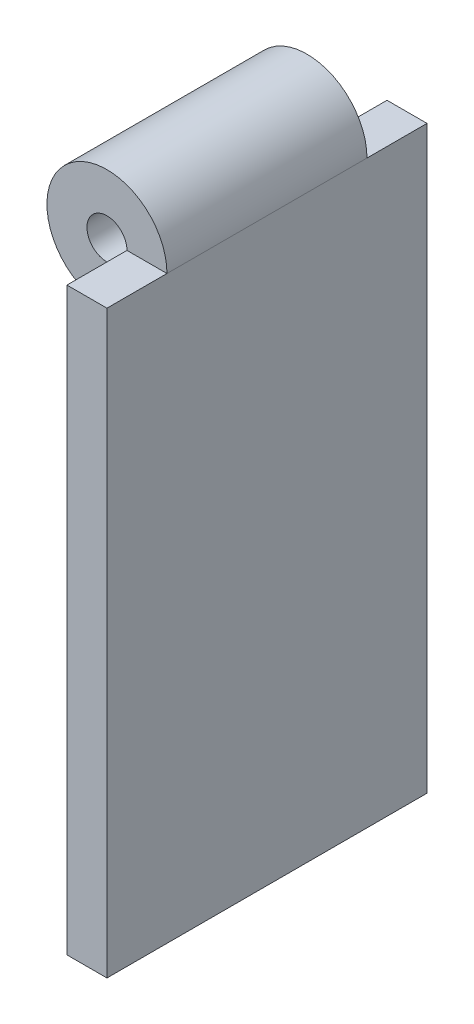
ISO-10303-21;
HEADER;
FILE_DESCRIPTION(('STEP AP214'),'2;1');
FILE_NAME('part.step','',(''),(''),'','','');
FILE_SCHEMA(('AUTOMOTIVE_DESIGN { 1 0 10303 214 1 1 1 1 }'));
ENDSEC;
DATA;
#1=APPLICATION_CONTEXT('core data for automotive mechanical design processes');
#2=APPLICATION_PROTOCOL_DEFINITION('international standard','automotive_design',2000,#1);
#3=PRODUCT_CONTEXT('',#1,'mechanical');
#4=PRODUCT('Part','Part','',(#3));
#5=PRODUCT_RELATED_PRODUCT_CATEGORY('part','',(#4));
#6=PRODUCT_DEFINITION_FORMATION('','',#4);
#7=PRODUCT_DEFINITION_CONTEXT('part definition',#1,'design');
#8=PRODUCT_DEFINITION('design','',#6,#7);
#9=PRODUCT_DEFINITION_SHAPE('','',#8);
#10=(LENGTH_UNIT() NAMED_UNIT(*) SI_UNIT(.MILLI.,.METRE.));
#11=(NAMED_UNIT(*) PLANE_ANGLE_UNIT() SI_UNIT($,.RADIAN.));
#12=(NAMED_UNIT(*) SI_UNIT($,.STERADIAN.) SOLID_ANGLE_UNIT());
#13=UNCERTAINTY_MEASURE_WITH_UNIT(LENGTH_MEASURE(1.E-05),#10,'distance_accuracy_value','');
#14=(GEOMETRIC_REPRESENTATION_CONTEXT(3) GLOBAL_UNCERTAINTY_ASSIGNED_CONTEXT((#13)) GLOBAL_UNIT_ASSIGNED_CONTEXT((#10,
#11,#12)) REPRESENTATION_CONTEXT('',''));
#15=CARTESIAN_POINT('',(0.,0.,0.));
#16=DIRECTION('',(0.,0.,1.));
#17=DIRECTION('',(1.,0.,0.));
#18=AXIS2_PLACEMENT_3D('',#15,#16,#17);
#19=CARTESIAN_POINT('',(3.51561230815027,0.,40.));
#20=DIRECTION('',(0.,-1.,0.));
#21=DIRECTION('',(1.,0.,0.));
#22=AXIS2_PLACEMENT_3D('',#19,#20,#21);
#23=PLANE('',#22);
#24=DIRECTION('',(-1.,0.,0.));
#25=VECTOR('',#24,1.);
#26=CARTESIAN_POINT('',(3.51561230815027,0.,-25.));
#27=LINE('',#26,#25);
#28=CARTESIAN_POINT('',(10.,0.,-25.));
#29=VERTEX_POINT('',#28);
#30=CARTESIAN_POINT('',(0.,0.,-25.));
#31=VERTEX_POINT('',#30);
#32=EDGE_CURVE('E151',#29,#31,#27,.T.);
#33=ORIENTED_EDGE('',*,*,#32,.F.);
#34=DIRECTION('',(0.,0.,-1.));
#35=VECTOR('',#34,1.);
#36=CARTESIAN_POINT('',(10.,0.,40.));
#37=LINE('',#36,#35);
#38=CARTESIAN_POINT('',(10.,0.,-40.));
#39=VERTEX_POINT('',#38);
#40=EDGE_CURVE('E42',#29,#39,#37,.T.);
#41=ORIENTED_EDGE('',*,*,#40,.T.);
#42=DIRECTION('',(-1.,0.,0.));
#43=VECTOR('',#42,1.);
#44=CARTESIAN_POINT('',(3.51561230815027,0.,-40.));
#45=LINE('',#44,#43);
#46=CARTESIAN_POINT('',(0.,0.,-40.));
#47=VERTEX_POINT('',#46);
#48=EDGE_CURVE('E180',#39,#47,#45,.T.);
#49=ORIENTED_EDGE('',*,*,#48,.T.);
#50=DIRECTION('',(0.,0.,-1.));
#51=VECTOR('',#50,1.);
#52=CARTESIAN_POINT('',(0.,0.,40.));
#53=LINE('',#52,#51);
#54=EDGE_CURVE('E154',#31,#47,#53,.T.);
#55=ORIENTED_EDGE('',*,*,#54,.F.);
#56=EDGE_LOOP('',(#33,#41,#49,#55));
#57=FACE_BOUND('',#56,.T.);
#58=ADVANCED_FACE('F34',(#57),#23,.F.);
#59=CARTESIAN_POINT('',(10.,-191.830988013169,40.));
#60=DIRECTION('',(-1.,0.,0.));
#61=DIRECTION('',(0.,-1.,0.));
#62=AXIS2_PLACEMENT_3D('',#59,#60,#61);
#63=PLANE('',#62);
#64=DIRECTION('',(0.,1.,0.));
#65=VECTOR('',#64,1.);
#66=CARTESIAN_POINT('',(10.,-191.830988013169,-40.));
#67=LINE('',#66,#65);
#68=CARTESIAN_POINT('',(10.,-145.,-40.));
#69=VERTEX_POINT('',#68);
#70=EDGE_CURVE('E133',#69,#39,#67,.T.);
#71=ORIENTED_EDGE('',*,*,#70,.T.);
#72=ORIENTED_EDGE('',*,*,#40,.F.);
#73=DIRECTION('',(0.,0.,-1.));
#74=VECTOR('',#73,1.);
#75=CARTESIAN_POINT('',(10.,0.,25.));
#76=LINE('',#75,#74);
#77=CARTESIAN_POINT('',(10.,0.,25.));
#78=VERTEX_POINT('',#77);
#79=EDGE_CURVE('E112',#78,#29,#76,.T.);
#80=ORIENTED_EDGE('',*,*,#79,.F.);
#81=CARTESIAN_POINT('',(10.,0.,40.));
#82=VERTEX_POINT('',#81);
#83=EDGE_CURVE('E11',#82,#78,#37,.T.);
#84=ORIENTED_EDGE('',*,*,#83,.F.);
#85=DIRECTION('',(0.,1.,0.));
#86=VECTOR('',#85,1.);
#87=CARTESIAN_POINT('',(10.,-191.830988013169,40.));
#88=LINE('',#87,#86);
#89=CARTESIAN_POINT('',(10.,-145.,40.));
#90=VERTEX_POINT('',#89);
#91=EDGE_CURVE('E172',#90,#82,#88,.T.);
#92=ORIENTED_EDGE('',*,*,#91,.F.);
#93=DIRECTION('',(0.,0.,-1.));
#94=VECTOR('',#93,1.);
#95=CARTESIAN_POINT('',(10.,-145.,40.));
#96=LINE('',#95,#94);
#97=EDGE_CURVE('E178',#90,#69,#96,.T.);
#98=ORIENTED_EDGE('',*,*,#97,.T.);
#99=EDGE_LOOP('',(#71,#72,#80,#84,#92,#98));
#100=FACE_BOUND('',#99,.T.);
#101=ADVANCED_FACE('F36',(#100),#63,.F.);
#102=ORIENTED_EDGE('',*,*,#83,.T.);
#103=DIRECTION('',(-1.,0.,0.));
#104=VECTOR('',#103,1.);
#105=CARTESIAN_POINT('',(3.51561230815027,0.,25.));
#106=LINE('',#105,#104);
#107=CARTESIAN_POINT('',(0.,0.,25.));
#108=VERTEX_POINT('',#107);
#109=EDGE_CURVE('E119',#78,#108,#106,.T.);
#110=ORIENTED_EDGE('',*,*,#109,.T.);
#111=CARTESIAN_POINT('',(0.,0.,40.));
#112=VERTEX_POINT('',#111);
#113=EDGE_CURVE('E187',#112,#108,#53,.T.);
#114=ORIENTED_EDGE('',*,*,#113,.F.);
#115=DIRECTION('',(-1.,0.,0.));
#116=VECTOR('',#115,1.);
#117=CARTESIAN_POINT('',(3.51561230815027,0.,40.));
#118=LINE('',#117,#116);
#119=EDGE_CURVE('E86',#82,#112,#118,.T.);
#120=ORIENTED_EDGE('',*,*,#119,.F.);
#121=EDGE_LOOP('',(#102,#110,#114,#120));
#122=FACE_BOUND('',#121,.T.);
#123=ADVANCED_FACE('F135',(#122),#23,.F.);
#124=CARTESIAN_POINT('',(0.,-191.830988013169,40.));
#125=DIRECTION('',(1.,0.,0.));
#126=DIRECTION('',(0.,1.,0.));
#127=AXIS2_PLACEMENT_3D('',#124,#125,#126);
#128=PLANE('',#127);
#129=DIRECTION('',(0.,-1.,0.));
#130=VECTOR('',#129,1.);
#131=CARTESIAN_POINT('',(0.,-191.830988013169,-40.));
#132=LINE('',#131,#130);
#133=CARTESIAN_POINT('',(0.,-145.,-40.));
#134=VERTEX_POINT('',#133);
#135=EDGE_CURVE('E182',#47,#134,#132,.T.);
#136=ORIENTED_EDGE('',*,*,#135,.T.);
#137=DIRECTION('',(0.,0.,-1.));
#138=VECTOR('',#137,1.);
#139=CARTESIAN_POINT('',(0.,-145.,40.));
#140=LINE('',#139,#138);
#141=CARTESIAN_POINT('',(0.,-145.,40.));
#142=VERTEX_POINT('',#141);
#143=EDGE_CURVE('E186',#142,#134,#140,.T.);
#144=ORIENTED_EDGE('',*,*,#143,.F.);
#145=DIRECTION('',(0.,-1.,0.));
#146=VECTOR('',#145,1.);
#147=CARTESIAN_POINT('',(0.,-191.830988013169,40.));
#148=LINE('',#147,#146);
#149=EDGE_CURVE('E175',#112,#142,#148,.T.);
#150=ORIENTED_EDGE('',*,*,#149,.F.);
#151=ORIENTED_EDGE('',*,*,#113,.T.);
#152=DIRECTION('',(0.,0.,-1.));
#153=VECTOR('',#152,1.);
#154=CARTESIAN_POINT('',(0.,0.,25.));
#155=LINE('',#154,#153);
#156=EDGE_CURVE('E167',#108,#31,#155,.T.);
#157=ORIENTED_EDGE('',*,*,#156,.T.);
#158=ORIENTED_EDGE('',*,*,#54,.T.);
#159=EDGE_LOOP('',(#136,#144,#150,#151,#157,#158));
#160=FACE_BOUND('',#159,.T.);
#161=ADVANCED_FACE('F137',(#160),#128,.F.);
#162=CARTESIAN_POINT('',(3.51561230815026,-145.,40.));
#163=DIRECTION('',(0.,1.,0.));
#164=DIRECTION('',(0.,0.,1.));
#165=AXIS2_PLACEMENT_3D('',#162,#163,#164);
#166=PLANE('',#165);
#167=DIRECTION('',(1.,0.,0.));
#168=VECTOR('',#167,1.);
#169=CARTESIAN_POINT('',(3.51561230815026,-145.,-40.));
#170=LINE('',#169,#168);
#171=EDGE_CURVE('E79',#134,#69,#170,.T.);
#172=ORIENTED_EDGE('',*,*,#171,.T.);
#173=ORIENTED_EDGE('',*,*,#97,.F.);
#174=DIRECTION('',(1.,0.,0.));
#175=VECTOR('',#174,1.);
#176=CARTESIAN_POINT('',(3.51561230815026,-145.,40.));
#177=LINE('',#176,#175);
#178=EDGE_CURVE('E58',#142,#90,#177,.T.);
#179=ORIENTED_EDGE('',*,*,#178,.F.);
#180=ORIENTED_EDGE('',*,*,#143,.T.);
#181=EDGE_LOOP('',(#172,#173,#179,#180));
#182=FACE_BOUND('',#181,.T.);
#183=ADVANCED_FACE('F142',(#182),#166,.F.);
#184=CARTESIAN_POINT('',(3.51561230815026,-191.830988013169,40.));
#185=DIRECTION('',(0.,0.,1.));
#186=DIRECTION('',(1.,0.,0.));
#187=AXIS2_PLACEMENT_3D('',#184,#185,#186);
#188=PLANE('',#187);
#189=ORIENTED_EDGE('',*,*,#91,.T.);
#190=ORIENTED_EDGE('',*,*,#119,.T.);
#191=ORIENTED_EDGE('',*,*,#149,.T.);
#192=ORIENTED_EDGE('',*,*,#178,.T.);
#193=EDGE_LOOP('',(#189,#190,#191,#192));
#194=FACE_BOUND('',#193,.T.);
#195=ADVANCED_FACE('F194',(#194),#188,.T.);
#196=CARTESIAN_POINT('',(3.51561230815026,-191.830988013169,-40.));
#197=DIRECTION('',(0.,0.,1.));
#198=DIRECTION('',(1.,0.,0.));
#199=AXIS2_PLACEMENT_3D('',#196,#197,#198);
#200=PLANE('',#199);
#201=ORIENTED_EDGE('',*,*,#70,.F.);
#202=ORIENTED_EDGE('',*,*,#171,.F.);
#203=ORIENTED_EDGE('',*,*,#135,.F.);
#204=ORIENTED_EDGE('',*,*,#48,.F.);
#205=EDGE_LOOP('',(#201,#202,#203,#204));
#206=FACE_BOUND('',#205,.T.);
#207=ADVANCED_FACE('F193',(#206),#200,.F.);
#208=CARTESIAN_POINT('',(-4.99999999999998,0.,25.));
#209=DIRECTION('',(0.,0.,-1.));
#210=DIRECTION('',(-1.,0.,0.));
#211=AXIS2_PLACEMENT_3D('',#208,#209,#210);
#212=CYLINDRICAL_SURFACE('',#211,15.);
#213=CARTESIAN_POINT('',(-4.99999999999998,0.,-25.));
#214=DIRECTION('',(0.,0.,1.));
#215=DIRECTION('',(1.,0.,0.));
#216=AXIS2_PLACEMENT_3D('',#213,#214,#215);
#217=CIRCLE('',#216,15.);
#218=CARTESIAN_POINT('',(-5.00000000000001,-15.,-25.));
#219=VERTEX_POINT('',#218);
#220=EDGE_CURVE('E157',#29,#219,#217,.T.);
#221=ORIENTED_EDGE('',*,*,#220,.T.);
#222=DIRECTION('',(0.,0.,-1.));
#223=VECTOR('',#222,1.);
#224=CARTESIAN_POINT('',(-5.00000000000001,-15.,25.));
#225=LINE('',#224,#223);
#226=CARTESIAN_POINT('',(-5.00000000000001,-15.,25.));
#227=VERTEX_POINT('',#226);
#228=EDGE_CURVE('E114',#227,#219,#225,.T.);
#229=ORIENTED_EDGE('',*,*,#228,.F.);
#230=CARTESIAN_POINT('',(-4.99999999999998,0.,25.));
#231=DIRECTION('',(0.,0.,1.));
#232=DIRECTION('',(1.,0.,0.));
#233=AXIS2_PLACEMENT_3D('',#230,#231,#232);
#234=CIRCLE('',#233,15.);
#235=EDGE_CURVE('E107',#78,#227,#234,.T.);
#236=ORIENTED_EDGE('',*,*,#235,.F.);
#237=ORIENTED_EDGE('',*,*,#79,.T.);
#238=EDGE_LOOP('',(#221,#229,#236,#237));
#239=FACE_BOUND('',#238,.T.);
#240=ADVANCED_FACE('F110',(#239),#212,.T.);
#241=CARTESIAN_POINT('',(-4.99999999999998,-191.830988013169,25.));
#242=DIRECTION('',(1.,0.,0.));
#243=DIRECTION('',(0.,1.,0.));
#244=AXIS2_PLACEMENT_3D('',#241,#242,#243);
#245=PLANE('',#244);
#246=DIRECTION('',(0.,-1.,0.));
#247=VECTOR('',#246,1.);
#248=CARTESIAN_POINT('',(-4.99999999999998,-191.830988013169,-25.));
#249=LINE('',#248,#247);
#250=CARTESIAN_POINT('',(-5.00000000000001,-5.,-25.));
#251=VERTEX_POINT('',#250);
#252=EDGE_CURVE('E159',#251,#219,#249,.T.);
#253=ORIENTED_EDGE('',*,*,#252,.F.);
#254=DIRECTION('',(0.,0.,-1.));
#255=VECTOR('',#254,1.);
#256=CARTESIAN_POINT('',(-5.00000000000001,-5.,25.));
#257=LINE('',#256,#255);
#258=CARTESIAN_POINT('',(-5.00000000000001,-5.,25.));
#259=VERTEX_POINT('',#258);
#260=EDGE_CURVE('E169',#259,#251,#257,.T.);
#261=ORIENTED_EDGE('',*,*,#260,.F.);
#262=DIRECTION('',(0.,-1.,0.));
#263=VECTOR('',#262,1.);
#264=CARTESIAN_POINT('',(-4.99999999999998,-191.830988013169,25.));
#265=LINE('',#264,#263);
#266=EDGE_CURVE('E118',#259,#227,#265,.T.);
#267=ORIENTED_EDGE('',*,*,#266,.T.);
#268=ORIENTED_EDGE('',*,*,#228,.T.);
#269=EDGE_LOOP('',(#253,#261,#267,#268));
#270=FACE_BOUND('',#269,.T.);
#271=ADVANCED_FACE('F206',(#270),#245,.T.);
#272=CARTESIAN_POINT('',(-5.,0.,25.));
#273=DIRECTION('',(0.,0.,-1.));
#274=DIRECTION('',(-1.,0.,0.));
#275=AXIS2_PLACEMENT_3D('',#272,#273,#274);
#276=CYLINDRICAL_SURFACE('',#275,5.);
#277=CARTESIAN_POINT('',(-5.,0.,-25.));
#278=DIRECTION('',(0.,0.,1.));
#279=DIRECTION('',(1.,0.,0.));
#280=AXIS2_PLACEMENT_3D('',#277,#278,#279);
#281=CIRCLE('',#280,5.);
#282=EDGE_CURVE('E49',#31,#251,#281,.T.);
#283=ORIENTED_EDGE('',*,*,#282,.F.);
#284=ORIENTED_EDGE('',*,*,#156,.F.);
#285=CARTESIAN_POINT('',(-5.,0.,25.));
#286=DIRECTION('',(0.,0.,1.));
#287=DIRECTION('',(1.,0.,0.));
#288=AXIS2_PLACEMENT_3D('',#285,#286,#287);
#289=CIRCLE('',#288,5.);
#290=EDGE_CURVE('E125',#108,#259,#289,.T.);
#291=ORIENTED_EDGE('',*,*,#290,.T.);
#292=ORIENTED_EDGE('',*,*,#260,.T.);
#293=EDGE_LOOP('',(#283,#284,#291,#292));
#294=FACE_BOUND('',#293,.T.);
#295=ADVANCED_FACE('F209',(#294),#276,.F.);
#296=CARTESIAN_POINT('',(3.51561230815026,-191.830988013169,25.));
#297=DIRECTION('',(0.,0.,1.));
#298=DIRECTION('',(1.,0.,0.));
#299=AXIS2_PLACEMENT_3D('',#296,#297,#298);
#300=PLANE('',#299);
#301=ORIENTED_EDGE('',*,*,#109,.F.);
#302=ORIENTED_EDGE('',*,*,#235,.T.);
#303=ORIENTED_EDGE('',*,*,#266,.F.);
#304=ORIENTED_EDGE('',*,*,#290,.F.);
#305=EDGE_LOOP('',(#301,#302,#303,#304));
#306=FACE_BOUND('',#305,.T.);
#307=ADVANCED_FACE('F123',(#306),#300,.T.);
#308=CARTESIAN_POINT('',(3.51561230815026,-191.830988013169,-25.));
#309=DIRECTION('',(0.,0.,1.));
#310=DIRECTION('',(1.,0.,0.));
#311=AXIS2_PLACEMENT_3D('',#308,#309,#310);
#312=PLANE('',#311);
#313=ORIENTED_EDGE('',*,*,#32,.T.);
#314=ORIENTED_EDGE('',*,*,#282,.T.);
#315=ORIENTED_EDGE('',*,*,#252,.T.);
#316=ORIENTED_EDGE('',*,*,#220,.F.);
#317=EDGE_LOOP('',(#313,#314,#315,#316));
#318=FACE_BOUND('',#317,.T.);
#319=ADVANCED_FACE('F213',(#318),#312,.F.);
#320=CLOSED_SHELL('',(#58,#101,#123,#161,#183,#195,#207,#240,#271,#295,#307,#319));
#321=MANIFOLD_SOLID_BREP('B2',#320);
#322=ADVANCED_BREP_SHAPE_REPRESENTATION('',(#18,#321),#14);
#323=SHAPE_DEFINITION_REPRESENTATION(#9,#322);
ENDSEC;
END-ISO-10303-21;
